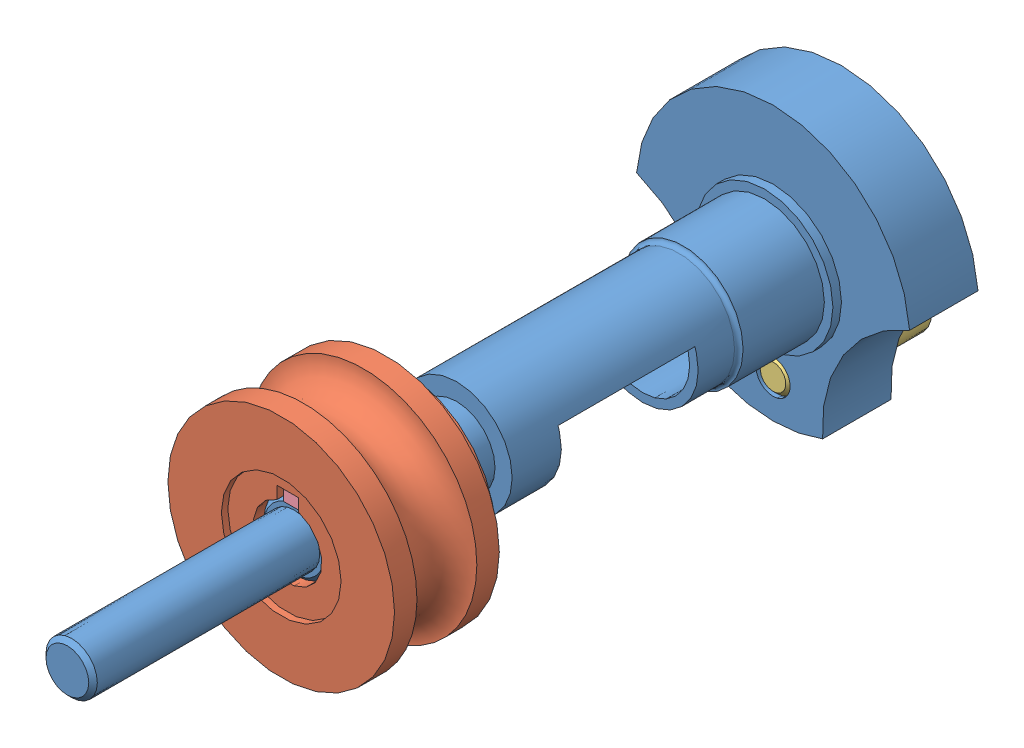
SolidWorks assembly vilebrequin.SLDASM, configuration Default (file format 10000). Lengths in mm.
Overall size (31.92 32 98.5).
4 component instances, 4 part files, 8 mates.
Components (placement in the parent):
- Vilebrequin-1: Vilebrequin.SLDPRT [Défaut] at origin size (31.92 32 90.5)
- Accouplement-1: Accouplement.SLDPRT [Défaut] at (0 0 50.75) x (0 -1 0) z (-1 0 0) size (26.5 14.75 26.5)
- Axe bielle-1: Axe bielle.SLDPRT [Défaut] at (0 -11.5 8) x (0.445654 -0.895205 0) z (0 0 1) size (6 6 16)
- Clavette-1: Clavette.SLDPRT [Défaut] at (0 5.25 52.75) x (1 0 0) z (0 -1 0) size (2.5 12.5 2)
Mates (geometry in assembly coordinates):
- Coaxial1: concentric aligned: cylinder of Vilebrequin-1 through (0 -11.5 0) axis (0 0 1) radius 2; cylinder of Axe bielle-1 through (0 -11.5 8) axis (0 0 1) radius 2
- Coïncidente1: coincident anti-aligned: plane of Vilebrequin-1 through (10.875 -6.875 0) normal (0 0 -1); plane of Axe bielle-1 through (0.8913 -13.2904 0) normal (0 0 1)
- Coaxial2: concentric anti-aligned: cylinder of Vilebrequin-1 through (0 0 64) axis (0 0 -1) radius 4; cylinder of Accouplement-1 through (0 0 50.75) axis (0 0 1) radius 4
- Coïncidente2: coincident anti-aligned: plane of Vilebrequin-1 through (0 3.25 52.75) normal (0 1 0); plane of Clavette-1 through (0 3.25 52.75) normal (0 -1 0)
- Coïncidente3: coincident anti-aligned: plane of Vilebrequin-1 through (1.25 16 64) normal (-1 0 0); plane of Clavette-1 through (1.25 3.25 64) normal (1 0 0)
- Coaxial3: concentric anti-aligned: cylinder of Vilebrequin-1 through (0 16 52.75) axis (0 -1 0) radius 1.25; cylinder of Clavette-1 through (0 3.25 52.75) axis (0 1 0) radius 1.25
- Coïncidente4: coincident anti-aligned: plane of Accouplement-1 through (-1.25 5.25 50.75) normal (1 0 0); plane of Clavette-1 through (-1.25 3.25 64) normal (-1 0 0)
- Coïncidente5: coincident anti-aligned: circle of Vilebrequin-1; plane of Accouplement-1 through (0 0 50.75) normal (0 0 -1)
